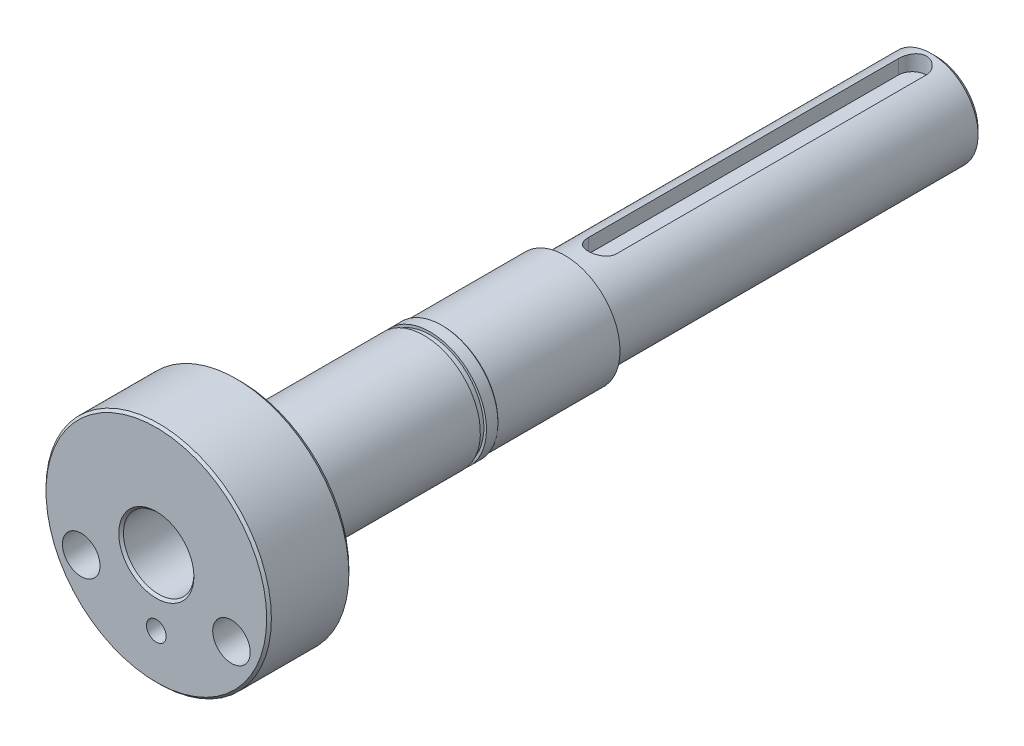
ISO-10303-21;
HEADER;
FILE_DESCRIPTION(('STEP AP214'),'2;1');
FILE_NAME('part.step','',(''),(''),'','','');
FILE_SCHEMA(('AUTOMOTIVE_DESIGN { 1 0 10303 214 1 1 1 1 }'));
ENDSEC;
DATA;
#1=APPLICATION_CONTEXT('core data for automotive mechanical design processes');
#2=APPLICATION_PROTOCOL_DEFINITION('international standard','automotive_design',2000,#1);
#3=PRODUCT_CONTEXT('',#1,'mechanical');
#4=PRODUCT('Part','Part','',(#3));
#5=PRODUCT_RELATED_PRODUCT_CATEGORY('part','',(#4));
#6=PRODUCT_DEFINITION_FORMATION('','',#4);
#7=PRODUCT_DEFINITION_CONTEXT('part definition',#1,'design');
#8=PRODUCT_DEFINITION('design','',#6,#7);
#9=PRODUCT_DEFINITION_SHAPE('','',#8);
#10=(LENGTH_UNIT() NAMED_UNIT(*) SI_UNIT(.MILLI.,.METRE.));
#11=(NAMED_UNIT(*) PLANE_ANGLE_UNIT() SI_UNIT($,.RADIAN.));
#12=(NAMED_UNIT(*) SI_UNIT($,.STERADIAN.) SOLID_ANGLE_UNIT());
#13=UNCERTAINTY_MEASURE_WITH_UNIT(LENGTH_MEASURE(1.E-05),#10,'distance_accuracy_value','');
#14=(GEOMETRIC_REPRESENTATION_CONTEXT(3) GLOBAL_UNCERTAINTY_ASSIGNED_CONTEXT((#13)) GLOBAL_UNIT_ASSIGNED_CONTEXT((#10,
#11,#12)) REPRESENTATION_CONTEXT('',''));
#15=CARTESIAN_POINT('',(0.,0.,0.));
#16=DIRECTION('',(0.,0.,1.));
#17=DIRECTION('',(1.,0.,0.));
#18=AXIS2_PLACEMENT_3D('',#15,#16,#17);
#19=CARTESIAN_POINT('',(0.,0.,0.));
#20=DIRECTION('',(0.,0.,1.));
#21=DIRECTION('',(1.00000000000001,0.,0.));
#22=AXIS2_PLACEMENT_3D('',#19,#20,#21);
#23=PLANE('',#22);
#24=CARTESIAN_POINT('',(0.,0.,0.));
#25=DIRECTION('',(0.,0.,1.));
#26=DIRECTION('',(1.00000000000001,0.,0.));
#27=AXIS2_PLACEMENT_3D('',#24,#25,#26);
#28=CIRCLE('',#27,23.);
#29=CARTESIAN_POINT('',(23.0000000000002,0.,0.));
#30=VERTEX_POINT('',#29);
#31=EDGE_CURVE('E174',#30,#30,#28,.F.);
#32=ORIENTED_EDGE('',*,*,#31,.T.);
#33=EDGE_LOOP('',(#32));
#34=FACE_BOUND('',#33,.T.);
#35=CARTESIAN_POINT('',(16.0000000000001,-8.00000000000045,0.));
#36=DIRECTION('',(0.,0.,1.));
#37=DIRECTION('',(1.00000000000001,0.,0.));
#38=AXIS2_PLACEMENT_3D('',#35,#36,#37);
#39=CIRCLE('',#38,3.99999999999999);
#40=CARTESIAN_POINT('',(20.0000000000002,-8.00000000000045,0.));
#41=VERTEX_POINT('',#40);
#42=EDGE_CURVE('E140',#41,#41,#39,.T.);
#43=ORIENTED_EDGE('',*,*,#42,.T.);
#44=EDGE_LOOP('',(#43));
#45=FACE_BOUND('',#44,.T.);
#46=CARTESIAN_POINT('',(-16.0000000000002,-8.00000000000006,-1.2490009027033E-13));
#47=DIRECTION('',(0.,0.,1.));
#48=DIRECTION('',(1.00000000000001,0.,0.));
#49=AXIS2_PLACEMENT_3D('',#46,#47,#48);
#50=CIRCLE('',#49,4.);
#51=CARTESIAN_POINT('',(-12.0000000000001,-8.00000000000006,-1.2490009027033E-13));
#52=VERTEX_POINT('',#51);
#53=EDGE_CURVE('E136',#52,#52,#50,.T.);
#54=ORIENTED_EDGE('',*,*,#53,.T.);
#55=EDGE_LOOP('',(#54));
#56=FACE_BOUND('',#55,.T.);
#57=CARTESIAN_POINT('',(0.,-14.,0.));
#58=DIRECTION('',(0.,0.,1.));
#59=DIRECTION('',(1.00000000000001,0.,0.));
#60=AXIS2_PLACEMENT_3D('',#57,#58,#59);
#61=CIRCLE('',#60,2.09999999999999);
#62=CARTESIAN_POINT('',(0.592633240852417,-11.9853571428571,0.));
#63=VERTEX_POINT('',#62);
#64=CARTESIAN_POINT('',(-0.592633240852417,-11.9853571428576,0.));
#65=VERTEX_POINT('',#64);
#66=EDGE_CURVE('E131',#63,#65,#61,.F.);
#67=ORIENTED_EDGE('',*,*,#66,.F.);
#68=CARTESIAN_POINT('',(0.,0.,0.));
#69=DIRECTION('',(0.,0.,1.));
#70=DIRECTION('',(1.00000000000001,0.,0.));
#71=AXIS2_PLACEMENT_3D('',#68,#69,#70);
#72=CIRCLE('',#71,12.);
#73=EDGE_CURVE('E167',#65,#63,#72,.F.);
#74=ORIENTED_EDGE('',*,*,#73,.F.);
#75=EDGE_LOOP('',(#67,#74));
#76=FACE_BOUND('',#75,.T.);
#77=ADVANCED_FACE('F40',(#34,#45,#56,#76),#23,.F.);
#78=CARTESIAN_POINT('',(0.,-4.9960036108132E-13,18.));
#79=DIRECTION('',(0.,0.,1.));
#80=DIRECTION('',(1.00000000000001,0.,0.));
#81=AXIS2_PLACEMENT_3D('',#78,#79,#80);
#82=PLANE('',#81);
#83=CARTESIAN_POINT('',(0.,-14.0000000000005,18.));
#84=DIRECTION('',(0.,0.,1.));
#85=DIRECTION('',(1.00000000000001,0.,0.));
#86=AXIS2_PLACEMENT_3D('',#83,#84,#85);
#87=CIRCLE('',#86,2.09999999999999);
#88=CARTESIAN_POINT('',(2.10000000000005,-14.0000000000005,18.));
#89=VERTEX_POINT('',#88);
#90=EDGE_CURVE('E121',#89,#89,#87,.T.);
#91=ORIENTED_EDGE('',*,*,#90,.F.);
#92=EDGE_LOOP('',(#91));
#93=FACE_BOUND('',#92,.T.);
#94=CARTESIAN_POINT('',(-16.,-8.00000000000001,18.));
#95=DIRECTION('',(0.,0.,1.));
#96=DIRECTION('',(1.00000000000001,0.,0.));
#97=AXIS2_PLACEMENT_3D('',#94,#95,#96);
#98=CIRCLE('',#97,4.);
#99=CARTESIAN_POINT('',(-12.,-8.00000000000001,18.));
#100=VERTEX_POINT('',#99);
#101=EDGE_CURVE('E133',#100,#100,#98,.T.);
#102=ORIENTED_EDGE('',*,*,#101,.F.);
#103=EDGE_LOOP('',(#102));
#104=FACE_BOUND('',#103,.T.);
#105=CARTESIAN_POINT('',(16.0000000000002,-8.00000000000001,18.));
#106=DIRECTION('',(0.,0.,1.));
#107=DIRECTION('',(1.00000000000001,0.,0.));
#108=AXIS2_PLACEMENT_3D('',#105,#106,#107);
#109=CIRCLE('',#108,3.99999999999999);
#110=CARTESIAN_POINT('',(20.0000000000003,-8.00000000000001,18.));
#111=VERTEX_POINT('',#110);
#112=EDGE_CURVE('E137',#111,#111,#109,.T.);
#113=ORIENTED_EDGE('',*,*,#112,.F.);
#114=EDGE_LOOP('',(#113));
#115=FACE_BOUND('',#114,.T.);
#116=CARTESIAN_POINT('',(0.,-4.9960036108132E-13,18.));
#117=DIRECTION('',(0.,0.,1.));
#118=DIRECTION('',(1.00000000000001,0.,0.));
#119=AXIS2_PLACEMENT_3D('',#116,#117,#118);
#120=CIRCLE('',#119,8.);
#121=CARTESIAN_POINT('',(8.00000000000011,-4.99600361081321E-13,18.));
#122=VERTEX_POINT('',#121);
#123=EDGE_CURVE('E192',#122,#122,#120,.F.);
#124=ORIENTED_EDGE('',*,*,#123,.T.);
#125=EDGE_LOOP('',(#124));
#126=FACE_BOUND('',#125,.T.);
#127=CARTESIAN_POINT('',(0.,-4.9960036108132E-13,18.));
#128=DIRECTION('',(0.,0.,1.));
#129=DIRECTION('',(1.00000000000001,0.,0.));
#130=AXIS2_PLACEMENT_3D('',#127,#128,#129);
#131=CIRCLE('',#130,23.5);
#132=CARTESIAN_POINT('',(23.5000000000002,-4.99600361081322E-13,18.));
#133=VERTEX_POINT('',#132);
#134=EDGE_CURVE('E183',#133,#133,#131,.T.);
#135=ORIENTED_EDGE('',*,*,#134,.T.);
#136=EDGE_LOOP('',(#135));
#137=FACE_BOUND('',#136,.T.);
#138=ADVANCED_FACE('F282',(#93,#104,#115,#126,#137),#82,.T.);
#139=CARTESIAN_POINT('',(0.,-4.9960036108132E-13,-69.));
#140=DIRECTION('',(0.,0.,-1.));
#141=DIRECTION('',(-1.00000000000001,0.,0.));
#142=AXIS2_PLACEMENT_3D('',#139,#140,#141);
#143=PLANE('',#142);
#144=CARTESIAN_POINT('',(0.,-4.9960036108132E-13,-69.));
#145=DIRECTION('',(0.,0.,-1.));
#146=DIRECTION('',(-1.00000000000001,0.,0.));
#147=AXIS2_PLACEMENT_3D('',#144,#145,#146);
#148=CIRCLE('',#147,11.75);
#149=CARTESIAN_POINT('',(11.7500000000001,-4.99600361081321E-13,-69.));
#150=VERTEX_POINT('',#149);
#151=EDGE_CURVE('E150',#150,#150,#148,.T.);
#152=ORIENTED_EDGE('',*,*,#151,.T.);
#153=EDGE_LOOP('',(#152));
#154=FACE_BOUND('',#153,.T.);
#155=CARTESIAN_POINT('',(0.,-4.9960036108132E-13,-69.));
#156=DIRECTION('',(0.,0.,-1.));
#157=DIRECTION('',(-1.00000000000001,0.,0.));
#158=AXIS2_PLACEMENT_3D('',#155,#156,#157);
#159=CIRCLE('',#158,10.);
#160=CARTESIAN_POINT('',(-10.,-4.9960036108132E-13,-69.));
#161=VERTEX_POINT('',#160);
#162=EDGE_CURVE('E144',#161,#161,#159,.T.);
#163=ORIENTED_EDGE('',*,*,#162,.F.);
#164=EDGE_LOOP('',(#163));
#165=FACE_BOUND('',#164,.T.);
#166=ADVANCED_FACE('F288',(#154,#165),#143,.T.);
#167=CARTESIAN_POINT('',(0.,-4.9960036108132E-13,-39.));
#168=DIRECTION('',(0.,0.,-1.));
#169=DIRECTION('',(-1.00000000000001,0.,0.));
#170=AXIS2_PLACEMENT_3D('',#167,#168,#169);
#171=PLANE('',#170);
#172=CARTESIAN_POINT('',(0.,-4.9960036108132E-13,-39.));
#173=DIRECTION('',(0.,0.,-1.));
#174=DIRECTION('',(-1.00000000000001,0.,0.));
#175=AXIS2_PLACEMENT_3D('',#172,#173,#174);
#176=CIRCLE('',#175,12.);
#177=CARTESIAN_POINT('',(-12.0000000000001,-4.9960036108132E-13,-39.));
#178=VERTEX_POINT('',#177);
#179=EDGE_CURVE('E164',#178,#178,#176,.T.);
#180=ORIENTED_EDGE('',*,*,#179,.T.);
#181=EDGE_LOOP('',(#180));
#182=FACE_BOUND('',#181,.T.);
#183=CARTESIAN_POINT('',(0.,-4.9960036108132E-13,-39.));
#184=DIRECTION('',(0.,0.,-1.));
#185=DIRECTION('',(-1.00000000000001,0.,0.));
#186=AXIS2_PLACEMENT_3D('',#183,#184,#185);
#187=CIRCLE('',#186,11.45);
#188=CARTESIAN_POINT('',(-11.4500000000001,-4.9960036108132E-13,-39.));
#189=VERTEX_POINT('',#188);
#190=EDGE_CURVE('E158',#189,#189,#187,.T.);
#191=ORIENTED_EDGE('',*,*,#190,.F.);
#192=EDGE_LOOP('',(#191));
#193=FACE_BOUND('',#192,.T.);
#194=ADVANCED_FACE('F297',(#182,#193),#171,.T.);
#195=CARTESIAN_POINT('',(0.,-4.9960036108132E-13,18.));
#196=DIRECTION('',(0.,0.,-1.));
#197=DIRECTION('',(-1.00000000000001,0.,0.));
#198=AXIS2_PLACEMENT_3D('',#195,#196,#197);
#199=CYLINDRICAL_SURFACE('',#198,24.);
#200=CARTESIAN_POINT('',(0.,-4.9960036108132E-13,17.5));
#201=DIRECTION('',(0.,0.,1.));
#202=DIRECTION('',(1.00000000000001,0.,0.));
#203=AXIS2_PLACEMENT_3D('',#200,#201,#202);
#204=CIRCLE('',#203,24.);
#205=CARTESIAN_POINT('',(24.0000000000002,-4.99600361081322E-13,17.5));
#206=VERTEX_POINT('',#205);
#207=EDGE_CURVE('E186',#206,#206,#204,.F.);
#208=ORIENTED_EDGE('',*,*,#207,.T.);
#209=EDGE_LOOP('',(#208));
#210=FACE_BOUND('',#209,.T.);
#211=CARTESIAN_POINT('',(0.,0.,1.));
#212=DIRECTION('',(0.,0.,1.));
#213=DIRECTION('',(1.00000000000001,0.,0.));
#214=AXIS2_PLACEMENT_3D('',#211,#212,#213);
#215=CIRCLE('',#214,24.);
#216=CARTESIAN_POINT('',(24.0000000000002,0.,1.));
#217=VERTEX_POINT('',#216);
#218=EDGE_CURVE('E171',#217,#217,#215,.T.);
#219=ORIENTED_EDGE('',*,*,#218,.T.);
#220=EDGE_LOOP('',(#219));
#221=FACE_BOUND('',#220,.T.);
#222=ADVANCED_FACE('F42',(#210,#221),#199,.T.);
#223=CARTESIAN_POINT('',(0.,-4.9960036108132E-13,-39.));
#224=DIRECTION('',(0.,0.,1.));
#225=DIRECTION('',(1.00000000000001,0.,0.));
#226=AXIS2_PLACEMENT_3D('',#223,#224,#225);
#227=CYLINDRICAL_SURFACE('',#226,12.);
#228=ORIENTED_EDGE('',*,*,#179,.F.);
#229=EDGE_LOOP('',(#228));
#230=FACE_BOUND('',#229,.T.);
#231=EDGE_CURVE('E168',#63,#65,#72,.F.);
#232=ORIENTED_EDGE('',*,*,#231,.T.);
#233=ORIENTED_EDGE('',*,*,#73,.T.);
#234=EDGE_LOOP('',(#232,#233));
#235=FACE_BOUND('',#234,.T.);
#236=ADVANCED_FACE('F292',(#230,#235),#227,.T.);
#237=CARTESIAN_POINT('',(0.,0.,-40.3));
#238=DIRECTION('',(0.,0.,1.));
#239=DIRECTION('',(1.00000000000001,0.,0.));
#240=AXIS2_PLACEMENT_3D('',#237,#238,#239);
#241=CYLINDRICAL_SURFACE('',#240,11.45);
#242=CARTESIAN_POINT('',(0.,0.,-40.3));
#243=DIRECTION('',(0.,0.,-1.));
#244=DIRECTION('',(-1.00000000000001,0.,0.));
#245=AXIS2_PLACEMENT_3D('',#242,#243,#244);
#246=CIRCLE('',#245,11.45);
#247=CARTESIAN_POINT('',(-11.4500000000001,0.,-40.3));
#248=VERTEX_POINT('',#247);
#249=EDGE_CURVE('E161',#248,#248,#246,.T.);
#250=ORIENTED_EDGE('',*,*,#249,.F.);
#251=EDGE_LOOP('',(#250));
#252=FACE_BOUND('',#251,.T.);
#253=ORIENTED_EDGE('',*,*,#190,.T.);
#254=EDGE_LOOP('',(#253));
#255=FACE_BOUND('',#254,.T.);
#256=ADVANCED_FACE('F295',(#252,#255),#241,.T.);
#257=CARTESIAN_POINT('',(0.,0.,-40.3));
#258=DIRECTION('',(0.,0.,-1.));
#259=DIRECTION('',(-1.00000000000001,0.,0.));
#260=AXIS2_PLACEMENT_3D('',#257,#258,#259);
#261=PLANE('',#260);
#262=CARTESIAN_POINT('',(0.,0.,-40.3));
#263=DIRECTION('',(0.,0.,-1.));
#264=DIRECTION('',(-1.00000000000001,0.,0.));
#265=AXIS2_PLACEMENT_3D('',#262,#263,#264);
#266=CIRCLE('',#265,12.);
#267=CARTESIAN_POINT('',(-12.0000000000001,0.,-40.3));
#268=VERTEX_POINT('',#267);
#269=EDGE_CURVE('E154',#268,#268,#266,.T.);
#270=ORIENTED_EDGE('',*,*,#269,.F.);
#271=EDGE_LOOP('',(#270));
#272=FACE_BOUND('',#271,.T.);
#273=ORIENTED_EDGE('',*,*,#249,.T.);
#274=EDGE_LOOP('',(#273));
#275=FACE_BOUND('',#274,.T.);
#276=ADVANCED_FACE('F303',(#272,#275),#261,.F.);
#277=CARTESIAN_POINT('',(0.,0.,-43.));
#278=DIRECTION('',(0.,0.,1.));
#279=DIRECTION('',(1.00000000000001,0.,0.));
#280=AXIS2_PLACEMENT_3D('',#277,#278,#279);
#281=CYLINDRICAL_SURFACE('',#280,12.);
#282=CARTESIAN_POINT('',(0.,0.,-42.7500000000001));
#283=DIRECTION('',(0.,0.,-1.));
#284=DIRECTION('',(0.,1.,0.));
#285=AXIS2_PLACEMENT_3D('',#282,#283,#284);
#286=CIRCLE('',#285,12.);
#287=CARTESIAN_POINT('',(0.,12.,-42.7500000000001));
#288=VERTEX_POINT('',#287);
#289=EDGE_CURVE('E11',#288,#288,#286,.F.);
#290=ORIENTED_EDGE('',*,*,#289,.T.);
#291=EDGE_LOOP('',(#290));
#292=FACE_BOUND('',#291,.T.);
#293=ORIENTED_EDGE('',*,*,#269,.T.);
#294=EDGE_LOOP('',(#293));
#295=FACE_BOUND('',#294,.T.);
#296=ADVANCED_FACE('F305',(#292,#295),#281,.T.);
#297=CARTESIAN_POINT('',(0.,-4.9960036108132E-13,-69.));
#298=DIRECTION('',(0.,0.,1.));
#299=DIRECTION('',(1.00000000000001,0.,0.));
#300=AXIS2_PLACEMENT_3D('',#297,#298,#299);
#301=CYLINDRICAL_SURFACE('',#300,11.75);
#302=CARTESIAN_POINT('',(0.,0.,-43.));
#303=DIRECTION('',(0.,0.,-1.));
#304=DIRECTION('',(-1.00000000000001,0.,0.));
#305=AXIS2_PLACEMENT_3D('',#302,#303,#304);
#306=CIRCLE('',#305,11.75);
#307=CARTESIAN_POINT('',(11.7500000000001,-4.99600361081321E-13,-43.));
#308=VERTEX_POINT('',#307);
#309=EDGE_CURVE('E147',#308,#308,#306,.T.);
#310=CARTESIAN_POINT('',(11.7500000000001,-4.99600361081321E-13,-69.));
#311=CARTESIAN_POINT('',(11.7500000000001,-4.99600361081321E-13,-68.7291666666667));
#312=CARTESIAN_POINT('',(11.7500000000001,-4.99600361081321E-13,-68.4583333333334));
#313=CARTESIAN_POINT('',(11.7500000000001,-4.99600361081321E-13,-67.9166666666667));
#314=CARTESIAN_POINT('',(11.7500000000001,-4.99600361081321E-13,-67.6458333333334));
#315=CARTESIAN_POINT('',(11.7500000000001,-4.99600361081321E-13,-67.1041666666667));
#316=CARTESIAN_POINT('',(11.7500000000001,-4.99600361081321E-13,-66.8333333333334));
#317=CARTESIAN_POINT('',(11.7500000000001,-4.99600361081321E-13,-66.2916666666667));
#318=CARTESIAN_POINT('',(11.7500000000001,-4.99600361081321E-13,-66.0208333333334));
#319=CARTESIAN_POINT('',(11.7500000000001,-4.99600361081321E-13,-65.4791666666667));
#320=CARTESIAN_POINT('',(11.7500000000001,-4.99600361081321E-13,-65.2083333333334));
#321=CARTESIAN_POINT('',(11.7500000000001,-4.99600361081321E-13,-64.6666666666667));
#322=CARTESIAN_POINT('',(11.7500000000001,-4.99600361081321E-13,-64.3958333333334));
#323=CARTESIAN_POINT('',(11.7500000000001,-4.99600361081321E-13,-63.8541666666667));
#324=CARTESIAN_POINT('',(11.7500000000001,-4.99600361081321E-13,-63.5833333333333));
#325=CARTESIAN_POINT('',(11.7500000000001,-4.99600361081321E-13,-63.0416666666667));
#326=CARTESIAN_POINT('',(11.7500000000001,-4.99600361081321E-13,-62.7708333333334));
#327=CARTESIAN_POINT('',(11.7500000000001,-4.99600361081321E-13,-62.2291666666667));
#328=CARTESIAN_POINT('',(11.7500000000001,-4.99600361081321E-13,-61.9583333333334));
#329=CARTESIAN_POINT('',(11.7500000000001,-4.99600361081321E-13,-61.4166666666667));
#330=CARTESIAN_POINT('',(11.7500000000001,-4.99600361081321E-13,-61.1458333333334));
#331=CARTESIAN_POINT('',(11.7500000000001,-4.99600361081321E-13,-60.6041666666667));
#332=CARTESIAN_POINT('',(11.7500000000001,-4.99600361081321E-13,-60.3333333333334));
#333=CARTESIAN_POINT('',(11.7500000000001,-4.99600361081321E-13,-59.7916666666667));
#334=CARTESIAN_POINT('',(11.7500000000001,-4.99600361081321E-13,-59.5208333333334));
#335=CARTESIAN_POINT('',(11.7500000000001,-4.99600361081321E-13,-58.9791666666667));
#336=CARTESIAN_POINT('',(11.7500000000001,-4.99600361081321E-13,-58.7083333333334));
#337=CARTESIAN_POINT('',(11.7500000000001,-4.99600361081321E-13,-58.1666666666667));
#338=CARTESIAN_POINT('',(11.7500000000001,-4.99600361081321E-13,-57.8958333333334));
#339=CARTESIAN_POINT('',(11.7500000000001,-4.99600361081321E-13,-57.3541666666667));
#340=CARTESIAN_POINT('',(11.7500000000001,-4.99600361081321E-13,-57.0833333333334));
#341=CARTESIAN_POINT('',(11.7500000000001,-4.99600361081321E-13,-56.5416666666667));
#342=CARTESIAN_POINT('',(11.7500000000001,-4.99600361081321E-13,-56.2708333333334));
#343=CARTESIAN_POINT('',(11.7500000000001,-4.99600361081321E-13,-55.7291666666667));
#344=CARTESIAN_POINT('',(11.7500000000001,-4.99600361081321E-13,-55.4583333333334));
#345=CARTESIAN_POINT('',(11.7500000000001,-4.99600361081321E-13,-54.9166666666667));
#346=CARTESIAN_POINT('',(11.7500000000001,-4.99600361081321E-13,-54.6458333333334));
#347=CARTESIAN_POINT('',(11.7500000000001,-4.99600361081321E-13,-54.1041666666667));
#348=CARTESIAN_POINT('',(11.7500000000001,-4.99600361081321E-13,-53.8333333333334));
#349=CARTESIAN_POINT('',(11.7500000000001,-4.99600361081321E-13,-53.2916666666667));
#350=CARTESIAN_POINT('',(11.7500000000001,-4.99600361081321E-13,-53.0208333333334));
#351=CARTESIAN_POINT('',(11.7500000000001,-4.99600361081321E-13,-52.4791666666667));
#352=CARTESIAN_POINT('',(11.7500000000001,-4.99600361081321E-13,-52.2083333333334));
#353=CARTESIAN_POINT('',(11.7500000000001,-4.99600361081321E-13,-51.6666666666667));
#354=CARTESIAN_POINT('',(11.7500000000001,-4.99600361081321E-13,-51.3958333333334));
#355=CARTESIAN_POINT('',(11.7500000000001,-4.99600361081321E-13,-50.8541666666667));
#356=CARTESIAN_POINT('',(11.7500000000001,-4.99600361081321E-13,-50.5833333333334));
#357=CARTESIAN_POINT('',(11.7500000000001,-4.99600361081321E-13,-50.0416666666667));
#358=CARTESIAN_POINT('',(11.7500000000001,-4.99600361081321E-13,-49.7708333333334));
#359=CARTESIAN_POINT('',(11.7500000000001,-4.99600361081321E-13,-49.2291666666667));
#360=CARTESIAN_POINT('',(11.7500000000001,-4.99600361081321E-13,-48.9583333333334));
#361=CARTESIAN_POINT('',(11.7500000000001,-4.99600361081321E-13,-48.4166666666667));
#362=CARTESIAN_POINT('',(11.7500000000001,-4.99600361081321E-13,-48.1458333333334));
#363=CARTESIAN_POINT('',(11.7500000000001,-4.99600361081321E-13,-47.6041666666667));
#364=CARTESIAN_POINT('',(11.7500000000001,-4.99600361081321E-13,-47.3333333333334));
#365=CARTESIAN_POINT('',(11.7500000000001,-4.99600361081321E-13,-46.7916666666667));
#366=CARTESIAN_POINT('',(11.7500000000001,-4.99600361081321E-13,-46.5208333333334));
#367=CARTESIAN_POINT('',(11.7500000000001,-4.99600361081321E-13,-45.9791666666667));
#368=CARTESIAN_POINT('',(11.7500000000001,-4.99600361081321E-13,-45.7083333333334));
#369=CARTESIAN_POINT('',(11.7500000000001,-4.99600361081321E-13,-45.1666666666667));
#370=CARTESIAN_POINT('',(11.7500000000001,-4.99600361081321E-13,-44.8958333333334));
#371=CARTESIAN_POINT('',(11.7500000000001,-4.99600361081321E-13,-44.3541666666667));
#372=CARTESIAN_POINT('',(11.7500000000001,-4.99600361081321E-13,-44.0833333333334));
#373=CARTESIAN_POINT('',(11.7500000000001,-4.99600361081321E-13,-43.5416666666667));
#374=CARTESIAN_POINT('',(11.7500000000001,-4.99600361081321E-13,-43.2708333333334));
#375=CARTESIAN_POINT('',(11.7500000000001,-4.99600361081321E-13,-43.));
#376=B_SPLINE_CURVE_WITH_KNOTS('',3,(#310,#311,#312,#313,#314,#315,#316,#317,#318,#319,#320,
#321,#322,#323,#324,#325,#326,#327,#328,#329,#330,#331,#332,#333,#334,#335,#336,#337,#338,#339,
#340,#341,#342,#343,#344,#345,#346,#347,#348,#349,#350,#351,#352,#353,#354,#355,#356,#357,#358,
#359,#360,#361,#362,#363,#364,#365,#366,#367,#368,#369,#370,#371,#372,#373,#374,#375),
.UNSPECIFIED.,.F.,.F.,(4,2,2,2,2,2,2,2,2,2,2,2,2,2,2,2,2,2,2,2,2,2,2,2,2,2,2,2,2,2,2,2,4),(0.,
0.812500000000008,1.625,2.43750000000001,3.25,4.06250000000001,4.875,5.68750000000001,
6.50000000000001,7.31250000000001,8.12500000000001,8.93750000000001,9.75000000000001,10.5625,
11.375,12.1875,13.,13.8125,14.625,15.4375,16.25,17.0625,17.875,18.6875,19.5,20.3125,21.125,
21.9375,22.75,23.5625,24.375,25.1875,26.),.UNSPECIFIED.);
#377=EDGE_CURVE('BSEAM277',#150,#308,#376,.T.);
#378=ORIENTED_EDGE('',*,*,#151,.F.);
#379=ORIENTED_EDGE('',*,*,#309,.T.);
#380=ORIENTED_EDGE('',*,*,#377,.T.);
#381=ORIENTED_EDGE('',*,*,#377,.F.);
#382=EDGE_LOOP('',(#378,#380,#379,#381));
#383=FACE_BOUND('',#382,.T.);
#384=ADVANCED_FACE('F277',(#383),#301,.T.);
#385=CARTESIAN_POINT('',(0.,0.,-148.));
#386=DIRECTION('',(0.,0.,1.));
#387=DIRECTION('',(1.00000000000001,0.,0.));
#388=AXIS2_PLACEMENT_3D('',#385,#386,#387);
#389=CYLINDRICAL_SURFACE('',#388,10.);
#390=CARTESIAN_POINT('',(0.,9.99999999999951,-74.));
#391=CARTESIAN_POINT('',(-0.164577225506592,9.9999985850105,-74.0000019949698));
#392=CARTESIAN_POINT('',(-0.329174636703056,9.99589831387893,-74.013587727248));
#393=CARTESIAN_POINT('',(-0.653576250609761,9.97994211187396,-74.0674427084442));
#394=CARTESIAN_POINT('',(-0.813379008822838,9.9680838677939,-74.1077199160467));
#395=CARTESIAN_POINT('',(-1.12346541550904,9.93791105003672,-74.2134920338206));
#396=CARTESIAN_POINT('',(-1.27376272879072,9.91960600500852,-74.2789497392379));
#397=CARTESIAN_POINT('',(-1.56124836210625,9.8784421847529,-74.4330721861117));
#398=CARTESIAN_POINT('',(-1.69843493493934,9.85558280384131,-74.5217400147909));
#399=CARTESIAN_POINT('',(-1.95974359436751,9.80701474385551,-74.7224480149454));
#400=CARTESIAN_POINT('',(-2.08343614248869,9.78124767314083,-74.8350332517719));
#401=CARTESIAN_POINT('',(-2.31049841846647,9.73011668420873,-75.0792184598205));
#402=CARTESIAN_POINT('',(-2.4138647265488,9.70475283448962,-75.21082162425));
#403=CARTESIAN_POINT('',(-2.59960075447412,9.65668227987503,-75.4929415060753));
#404=CARTESIAN_POINT('',(-2.68144618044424,9.63404813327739,-75.6438169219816));
#405=CARTESIAN_POINT('',(-2.81842789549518,9.59487240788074,-75.9579785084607));
#406=CARTESIAN_POINT('',(-2.87357059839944,9.57832936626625,-76.121261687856));
#407=CARTESIAN_POINT('',(-2.95403267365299,9.55381741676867,-76.4507805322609));
#408=CARTESIAN_POINT('',(-2.98014392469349,9.54562138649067,-76.6168054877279));
#409=CARTESIAN_POINT('',(-3.00427461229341,9.53805579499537,-76.9510663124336));
#410=CARTESIAN_POINT('',(-3.00230085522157,9.53868409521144,-77.1193016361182));
#411=CARTESIAN_POINT('',(-2.97093954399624,9.54849488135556,-77.446767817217));
#412=CARTESIAN_POINT('',(-2.94254410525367,9.55736777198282,-77.6061045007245));
#413=CARTESIAN_POINT('',(-2.86074840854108,9.5821671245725,-77.9176395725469));
#414=CARTESIAN_POINT('',(-2.80734568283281,9.59809428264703,-78.0698372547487));
#415=CARTESIAN_POINT('',(-2.67632053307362,9.63545466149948,-78.3652006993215));
#416=CARTESIAN_POINT('',(-2.59837633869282,9.65696032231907,-78.5082141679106));
#417=CARTESIAN_POINT('',(-2.42070445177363,9.70301974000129,-78.7794640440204));
#418=CARTESIAN_POINT('',(-2.32097148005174,9.7275742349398,-78.9076968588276));
#419=CARTESIAN_POINT('',(-2.09762581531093,9.77822022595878,-79.1513723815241));
#420=CARTESIAN_POINT('',(-1.97318981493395,9.80433308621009,-79.2660573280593));
#421=CARTESIAN_POINT('',(-1.70652651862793,9.85424488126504,-79.4731079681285));
#422=CARTESIAN_POINT('',(-1.56429810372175,9.87804367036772,-79.5654722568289));
#423=CARTESIAN_POINT('',(-1.26471007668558,9.92086320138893,-79.7257198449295));
#424=CARTESIAN_POINT('',(-1.10725549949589,9.93985087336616,-79.7934350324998));
#425=CARTESIAN_POINT('',(-0.782490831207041,9.97067043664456,-79.9011991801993));
#426=CARTESIAN_POINT('',(-0.615183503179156,9.98250432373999,-79.941255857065));
#427=CARTESIAN_POINT('',(-0.281904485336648,9.99736729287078,-79.9913043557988));
#428=CARTESIAN_POINT('',(-0.11610019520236,10.0006970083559,-80.0023231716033));
#429=CARTESIAN_POINT('',(0.214999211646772,9.99905846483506,-79.9968616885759));
#430=CARTESIAN_POINT('',(0.380294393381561,9.99409131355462,-79.9803850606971));
#431=CARTESIAN_POINT('',(0.701807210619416,9.97661393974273,-79.921230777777));
#432=CARTESIAN_POINT('',(0.858145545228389,9.96427659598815,-79.8791532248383));
#433=CARTESIAN_POINT('',(1.1615092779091,9.93348695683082,-79.7707135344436));
#434=CARTESIAN_POINT('',(1.30853355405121,9.91503392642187,-79.7043484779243));
#435=CARTESIAN_POINT('',(1.59287437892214,9.87339308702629,-79.5474936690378));
#436=CARTESIAN_POINT('',(1.72988765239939,9.8501056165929,-79.4564813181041));
#437=CARTESIAN_POINT('',(1.98704661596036,9.80146937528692,-79.2535504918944));
#438=CARTESIAN_POINT('',(2.10718806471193,9.77612008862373,-79.1416267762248));
#439=CARTESIAN_POINT('',(2.33171489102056,9.72506343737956,-78.8952253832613));
#440=CARTESIAN_POINT('',(2.43536962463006,9.69937650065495,-78.7600762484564));
#441=CARTESIAN_POINT('',(2.6185799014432,9.65153030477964,-78.4737441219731));
#442=CARTESIAN_POINT('',(2.69813607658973,9.62937095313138,-78.3225615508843));
#443=CARTESIAN_POINT('',(2.83034694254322,9.59134379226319,-78.00893501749));
#444=CARTESIAN_POINT('',(2.88312693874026,9.57544675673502,-77.8465476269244));
#445=CARTESIAN_POINT('',(2.96043461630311,9.55183188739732,-77.5146240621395));
#446=CARTESIAN_POINT('',(2.98497197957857,9.54411125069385,-77.3450903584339));
#447=CARTESIAN_POINT('',(3.00443968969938,9.53799944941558,-77.0112769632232));
#448=CARTESIAN_POINT('',(3.00056110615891,9.53923294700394,-76.8470726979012));
#449=CARTESIAN_POINT('',(2.96615010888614,9.54998802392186,-76.5217717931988));
#450=CARTESIAN_POINT('',(2.93561876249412,9.55950927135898,-76.360675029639));
#451=CARTESIAN_POINT('',(2.84953777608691,9.5855152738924,-76.0481092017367));
#452=CARTESIAN_POINT('',(2.79430351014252,9.60191209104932,-75.8965454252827));
#453=CARTESIAN_POINT('',(2.66063014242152,9.63980557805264,-75.6047151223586));
#454=CARTESIAN_POINT('',(2.58218659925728,9.66130322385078,-75.4644507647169));
#455=CARTESIAN_POINT('',(2.40097527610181,9.70795352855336,-75.1936737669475));
#456=CARTESIAN_POINT('',(2.29742552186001,9.73321080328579,-75.0637024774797));
#457=CARTESIAN_POINT('',(2.07034869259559,9.78402640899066,-74.8225950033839));
#458=CARTESIAN_POINT('',(1.946816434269,9.80958481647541,-74.7114637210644));
#459=CARTESIAN_POINT('',(1.67893152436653,9.85901873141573,-74.5079531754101));
#460=CARTESIAN_POINT('',(1.53407577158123,9.88282319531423,-74.4162171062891));
#461=CARTESIAN_POINT('',(1.23028274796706,9.92521360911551,-74.2585296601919));
#462=CARTESIAN_POINT('',(1.07135210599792,9.94380199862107,-74.192566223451));
#463=CARTESIAN_POINT('',(0.761515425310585,9.97204349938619,-74.0942094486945));
#464=CARTESIAN_POINT('',(0.611573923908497,9.98244054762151,-74.0589766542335));
#465=CARTESIAN_POINT('',(0.307760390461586,9.99641888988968,-74.0118729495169));
#466=CARTESIAN_POINT('',(0.153889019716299,10.0000013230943,-73.9999981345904));
#467=CARTESIAN_POINT('',(0.,9.99999999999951,-74.));
#468=B_SPLINE_CURVE_WITH_KNOTS('',3,(#390,#391,#392,#393,#394,#395,#396,#397,#398,#399,#400,
#401,#402,#403,#404,#405,#406,#407,#408,#409,#410,#411,#412,#413,#414,#415,#416,#417,#418,#419,
#420,#421,#422,#423,#424,#425,#426,#427,#428,#429,#430,#431,#432,#433,#434,#435,#436,#437,#438,
#439,#440,#441,#442,#443,#444,#445,#446,#447,#448,#449,#450,#451,#452,#453,#454,#455,#456,#457,
#458,#459,#460,#461,#462,#463,#464,#465,#466,#467),.UNSPECIFIED.,.T.,.F.,(4,2,2,2,2,2,2,2,2,2,2,
2,2,2,2,2,2,2,2,2,2,2,2,2,2,2,2,2,2,2,2,2,2,2,2,2,2,2,4),(0.,0.493166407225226,
0.986479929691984,1.47906735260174,1.97172032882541,2.47711205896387,2.98258874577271,
3.4994296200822,4.01614629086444,4.51839378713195,5.02051956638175,5.50452033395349,
5.98856887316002,6.47924852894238,6.97004720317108,7.48134208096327,7.99266913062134,
8.50742093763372,9.0220290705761,9.51817618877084,10.0142570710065,10.4991349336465,
10.9840710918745,11.4802261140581,11.9765056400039,12.4908080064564,13.0050968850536,
13.516956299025,14.0286401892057,14.5190031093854,15.0093463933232,15.4936008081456,
15.9779479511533,16.4799385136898,16.9820594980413,17.4988599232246,18.0154182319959,
18.4766338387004,18.9377723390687),.UNSPECIFIED.);
#469=CARTESIAN_POINT('',(3.00000000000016,9.53939201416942,-76.9999999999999));
#470=VERTEX_POINT('',#469);
#471=CARTESIAN_POINT('',(-3.,9.53939201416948,-77.));
#472=VERTEX_POINT('',#471);
#473=EDGE_CURVE('E207',#470,#472,#468,.T.);
#474=ORIENTED_EDGE('',*,*,#473,.T.);
#475=DIRECTION('',(0.,0.,1.));
#476=VECTOR('',#475,1.);
#477=CARTESIAN_POINT('',(-3.00000000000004,9.53939201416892,-148.));
#478=LINE('',#477,#476);
#479=CARTESIAN_POINT('',(-3.00000000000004,9.53939201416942,-143.));
#480=VERTEX_POINT('',#479);
#481=EDGE_CURVE('E48',#472,#480,#478,.F.);
#482=ORIENTED_EDGE('',*,*,#481,.T.);
#483=CARTESIAN_POINT('',(0.,10.,-140.));
#484=CARTESIAN_POINT('',(-0.164577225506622,9.99999858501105,-140.00000199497));
#485=CARTESIAN_POINT('',(-0.329174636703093,9.99589831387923,-140.013587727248));
#486=CARTESIAN_POINT('',(-0.653576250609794,9.97994211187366,-140.067442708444));
#487=CARTESIAN_POINT('',(-0.813379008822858,9.96808386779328,-140.107719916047));
#488=CARTESIAN_POINT('',(-1.12346541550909,9.93791105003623,-140.213492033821));
#489=CARTESIAN_POINT('',(-1.27376272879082,9.91960600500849,-140.278949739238));
#490=CARTESIAN_POINT('',(-1.56124836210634,9.8784421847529,-140.433072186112));
#491=CARTESIAN_POINT('',(-1.69843493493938,9.85558280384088,-140.521740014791));
#492=CARTESIAN_POINT('',(-1.95974359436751,9.80701474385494,-140.722448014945));
#493=CARTESIAN_POINT('',(-2.08343614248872,9.78124767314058,-140.835033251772));
#494=CARTESIAN_POINT('',(-2.31049841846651,9.73011668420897,-141.07921845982));
#495=CARTESIAN_POINT('',(-2.41386472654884,9.70475283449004,-141.21082162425));
#496=CARTESIAN_POINT('',(-2.59960075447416,9.65668227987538,-141.492941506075));
#497=CARTESIAN_POINT('',(-2.68144618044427,9.63404813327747,-141.643816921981));
#498=CARTESIAN_POINT('',(-2.81842789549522,9.59487240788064,-141.957978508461));
#499=CARTESIAN_POINT('',(-2.87357059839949,9.57832936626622,-142.121261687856));
#500=CARTESIAN_POINT('',(-2.95403267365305,9.55381741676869,-142.450780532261));
#501=CARTESIAN_POINT('',(-2.98014392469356,9.54562138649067,-142.616805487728));
#502=CARTESIAN_POINT('',(-3.00427461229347,9.53805579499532,-142.951066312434));
#503=CARTESIAN_POINT('',(-3.00230085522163,9.53868409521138,-143.119301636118));
#504=CARTESIAN_POINT('',(-2.97093954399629,9.54849488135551,-143.446767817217));
#505=CARTESIAN_POINT('',(-2.94254410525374,9.5573677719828,-143.606104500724));
#506=CARTESIAN_POINT('',(-2.86074840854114,9.58216712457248,-143.917639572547));
#507=CARTESIAN_POINT('',(-2.80734568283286,9.59809428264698,-144.069837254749));
#508=CARTESIAN_POINT('',(-2.67632053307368,9.63545466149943,-144.365200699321));
#509=CARTESIAN_POINT('',(-2.59837633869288,9.65696032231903,-144.508214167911));
#510=CARTESIAN_POINT('',(-2.42070445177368,9.7030197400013,-144.77946404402));
#511=CARTESIAN_POINT('',(-2.32097148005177,9.72757423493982,-144.907696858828));
#512=CARTESIAN_POINT('',(-2.09762581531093,9.77822022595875,-145.151372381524));
#513=CARTESIAN_POINT('',(-1.97318981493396,9.80433308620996,-145.266057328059));
#514=CARTESIAN_POINT('',(-1.70652651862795,9.85424488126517,-145.473107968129));
#515=CARTESIAN_POINT('',(-1.56429810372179,9.87804367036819,-145.565472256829));
#516=CARTESIAN_POINT('',(-1.26471007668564,9.92086320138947,-145.725719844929));
#517=CARTESIAN_POINT('',(-1.10725549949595,9.93985087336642,-145.7934350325));
#518=CARTESIAN_POINT('',(-0.782490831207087,9.97067043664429,-145.901199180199));
#519=CARTESIAN_POINT('',(-0.615183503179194,9.98250432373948,-145.941255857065));
#520=CARTESIAN_POINT('',(-0.28190448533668,9.99736729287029,-145.991304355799));
#521=CARTESIAN_POINT('',(-0.116100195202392,10.0006970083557,-146.002323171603));
#522=CARTESIAN_POINT('',(0.214999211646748,9.99905846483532,-145.996861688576));
#523=CARTESIAN_POINT('',(0.380294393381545,9.99409131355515,-145.980385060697));
#524=CARTESIAN_POINT('',(0.701807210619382,9.97661393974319,-145.921230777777));
#525=CARTESIAN_POINT('',(0.858145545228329,9.96427659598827,-145.879153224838));
#526=CARTESIAN_POINT('',(1.16150927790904,9.93348695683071,-145.770713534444));
#527=CARTESIAN_POINT('',(1.30853355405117,9.91503392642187,-145.704348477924));
#528=CARTESIAN_POINT('',(1.59287437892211,9.87339308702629,-145.547493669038));
#529=CARTESIAN_POINT('',(1.72988765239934,9.85010561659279,-145.456481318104));
#530=CARTESIAN_POINT('',(1.98704661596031,9.80146937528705,-145.253550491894));
#531=CARTESIAN_POINT('',(2.1071880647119,9.77612008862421,-145.141626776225));
#532=CARTESIAN_POINT('',(2.33171489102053,9.72506343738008,-144.895225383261));
#533=CARTESIAN_POINT('',(2.43536962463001,9.69937650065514,-144.760076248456));
#534=CARTESIAN_POINT('',(2.61857990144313,9.65153030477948,-144.473744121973));
#535=CARTESIAN_POINT('',(2.69813607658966,9.6293709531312,-144.322561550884));
#536=CARTESIAN_POINT('',(2.83034694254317,9.59134379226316,-144.00893501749));
#537=CARTESIAN_POINT('',(2.88312693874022,9.57544675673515,-143.846547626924));
#538=CARTESIAN_POINT('',(2.96043461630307,9.55183188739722,-143.514624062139));
#539=CARTESIAN_POINT('',(2.98497197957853,9.54411125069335,-143.345090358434));
#540=CARTESIAN_POINT('',(3.00443968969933,9.53799944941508,-143.011276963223));
#541=CARTESIAN_POINT('',(3.00056110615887,9.53923294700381,-142.847072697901));
#542=CARTESIAN_POINT('',(2.9661501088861,9.54998802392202,-142.521771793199));
#543=CARTESIAN_POINT('',(2.93561876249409,9.55950927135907,-142.360675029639));
#544=CARTESIAN_POINT('',(2.84953777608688,9.58551527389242,-142.048109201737));
#545=CARTESIAN_POINT('',(2.79430351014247,9.60191209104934,-141.896545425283));
#546=CARTESIAN_POINT('',(2.66063014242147,9.63980557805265,-141.604715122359));
#547=CARTESIAN_POINT('',(2.58218659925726,9.66130322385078,-141.464450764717));
#548=CARTESIAN_POINT('',(2.4009752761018,9.70795352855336,-141.193673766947));
#549=CARTESIAN_POINT('',(2.29742552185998,9.73321080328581,-141.06370247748));
#550=CARTESIAN_POINT('',(2.07034869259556,9.78402640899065,-140.822595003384));
#551=CARTESIAN_POINT('',(1.94681643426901,9.80958481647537,-140.711463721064));
#552=CARTESIAN_POINT('',(1.67893152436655,9.85901873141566,-140.50795317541));
#553=CARTESIAN_POINT('',(1.53407577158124,9.88282319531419,-140.416217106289));
#554=CARTESIAN_POINT('',(1.23028274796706,9.92521360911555,-140.258529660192));
#555=CARTESIAN_POINT('',(1.07135210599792,9.94380199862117,-140.192566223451));
#556=CARTESIAN_POINT('',(0.761515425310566,9.97204349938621,-140.094209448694));
#557=CARTESIAN_POINT('',(0.611573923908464,9.98244054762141,-140.058976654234));
#558=CARTESIAN_POINT('',(0.307760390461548,9.99641888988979,-140.011872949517));
#559=CARTESIAN_POINT('',(0.153889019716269,10.0000013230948,-139.99999813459));
#560=CARTESIAN_POINT('',(0.,10.,-140.));
#561=B_SPLINE_CURVE_WITH_KNOTS('',3,(#483,#484,#485,#486,#487,#488,#489,#490,#491,#492,#493,
#494,#495,#496,#497,#498,#499,#500,#501,#502,#503,#504,#505,#506,#507,#508,#509,#510,#511,#512,
#513,#514,#515,#516,#517,#518,#519,#520,#521,#522,#523,#524,#525,#526,#527,#528,#529,#530,#531,
#532,#533,#534,#535,#536,#537,#538,#539,#540,#541,#542,#543,#544,#545,#546,#547,#548,#549,#550,
#551,#552,#553,#554,#555,#556,#557,#558,#559,#560),.UNSPECIFIED.,.T.,.F.,(4,2,2,2,2,2,2,2,2,2,2,
2,2,2,2,2,2,2,2,2,2,2,2,2,2,2,2,2,2,2,2,2,2,2,2,2,2,2,4),(0.,0.493166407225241,
0.986479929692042,1.4790673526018,1.97172032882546,2.47711205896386,2.98258874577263,
3.49942962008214,4.01614629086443,4.51839378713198,5.02051956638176,5.5045203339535,
5.98856887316,6.47924852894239,6.97004720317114,7.48134208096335,7.99266913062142,
8.50742093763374,9.02202907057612,9.51817618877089,10.0142570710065,10.4991349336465,
10.9840710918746,11.4802261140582,11.9765056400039,12.4908080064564,13.0050968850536,
13.5169562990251,14.0286401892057,14.5190031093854,15.0093463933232,15.4936008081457,
15.9779479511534,16.4799385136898,16.9820594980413,17.4988599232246,18.015418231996,
18.4766338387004,18.9377723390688),.UNSPECIFIED.);
#562=CARTESIAN_POINT('',(3.00000000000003,9.53939201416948,-143.));
#563=VERTEX_POINT('',#562);
#564=EDGE_CURVE('E195',#480,#563,#561,.T.);
#565=ORIENTED_EDGE('',*,*,#564,.T.);
#566=DIRECTION('',(0.,0.,1.));
#567=VECTOR('',#566,1.);
#568=CARTESIAN_POINT('',(3.00000000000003,9.53939201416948,-148.));
#569=LINE('',#568,#567);
#570=EDGE_CURVE('E341',#563,#470,#569,.T.);
#571=ORIENTED_EDGE('',*,*,#570,.T.);
#572=EDGE_LOOP('',(#474,#482,#565,#571));
#573=FACE_BOUND('',#572,.T.);
#574=CARTESIAN_POINT('',(0.,0.,-147.));
#575=DIRECTION('',(0.,0.,-1.));
#576=DIRECTION('',(-1.00000000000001,0.,0.));
#577=AXIS2_PLACEMENT_3D('',#574,#575,#576);
#578=CIRCLE('',#577,10.);
#579=CARTESIAN_POINT('',(-10.0000000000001,0.,-147.));
#580=VERTEX_POINT('',#579);
#581=EDGE_CURVE('E180',#580,#580,#578,.F.);
#582=ORIENTED_EDGE('',*,*,#581,.T.);
#583=EDGE_LOOP('',(#582));
#584=FACE_BOUND('',#583,.T.);
#585=ORIENTED_EDGE('',*,*,#162,.T.);
#586=EDGE_LOOP('',(#585));
#587=FACE_BOUND('',#586,.T.);
#588=ADVANCED_FACE('F213',(#573,#584,#587),#389,.T.);
#589=CARTESIAN_POINT('',(0.,0.,-148.));
#590=DIRECTION('',(0.,0.,-1.));
#591=DIRECTION('',(-1.00000000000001,0.,0.));
#592=AXIS2_PLACEMENT_3D('',#589,#590,#591);
#593=PLANE('',#592);
#594=CARTESIAN_POINT('',(0.,0.,-148.));
#595=DIRECTION('',(0.,0.,-1.));
#596=DIRECTION('',(-1.00000000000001,0.,0.));
#597=AXIS2_PLACEMENT_3D('',#594,#595,#596);
#598=CIRCLE('',#597,2.5);
#599=CARTESIAN_POINT('',(-2.50000000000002,0.,-148.));
#600=VERTEX_POINT('',#599);
#601=EDGE_CURVE('E101',#600,#600,#598,.T.);
#602=ORIENTED_EDGE('',*,*,#601,.F.);
#603=EDGE_LOOP('',(#602));
#604=FACE_BOUND('',#603,.T.);
#605=CARTESIAN_POINT('',(0.,0.,-148.));
#606=DIRECTION('',(0.,0.,-1.));
#607=DIRECTION('',(-1.00000000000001,0.,0.));
#608=AXIS2_PLACEMENT_3D('',#605,#606,#607);
#609=CIRCLE('',#608,9.);
#610=CARTESIAN_POINT('',(-9.00000000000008,0.,-148.));
#611=VERTEX_POINT('',#610);
#612=EDGE_CURVE('E177',#611,#611,#609,.T.);
#613=ORIENTED_EDGE('',*,*,#612,.T.);
#614=EDGE_LOOP('',(#613));
#615=FACE_BOUND('',#614,.T.);
#616=ADVANCED_FACE('F270',(#604,#615),#593,.T.);
#617=CARTESIAN_POINT('',(0.,0.,1.));
#618=DIRECTION('',(0.,0.,1.));
#619=DIRECTION('',(1.00000000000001,0.,0.));
#620=AXIS2_PLACEMENT_3D('',#617,#618,#619);
#621=CONICAL_SURFACE('',#620,24.,0.78539816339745);
#622=ORIENTED_EDGE('',*,*,#31,.F.);
#623=EDGE_LOOP('',(#622));
#624=FACE_BOUND('',#623,.T.);
#625=ORIENTED_EDGE('',*,*,#218,.F.);
#626=EDGE_LOOP('',(#625));
#627=FACE_BOUND('',#626,.T.);
#628=ADVANCED_FACE('F267',(#624,#627),#621,.T.);
#629=CARTESIAN_POINT('',(0.,0.,-148.));
#630=DIRECTION('',(0.,0.,1.));
#631=DIRECTION('',(1.00000000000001,0.,0.));
#632=AXIS2_PLACEMENT_3D('',#629,#630,#631);
#633=CONICAL_SURFACE('',#632,9.,0.785398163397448);
#634=ORIENTED_EDGE('',*,*,#581,.F.);
#635=EDGE_LOOP('',(#634));
#636=FACE_BOUND('',#635,.T.);
#637=ORIENTED_EDGE('',*,*,#612,.F.);
#638=EDGE_LOOP('',(#637));
#639=FACE_BOUND('',#638,.T.);
#640=ADVANCED_FACE('F263',(#636,#639),#633,.T.);
#641=CARTESIAN_POINT('',(0.,-4.9960036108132E-13,18.));
#642=DIRECTION('',(0.,0.,-1.));
#643=DIRECTION('',(-1.00000000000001,0.,0.));
#644=AXIS2_PLACEMENT_3D('',#641,#642,#643);
#645=CONICAL_SURFACE('',#644,23.5,0.785398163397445);
#646=ORIENTED_EDGE('',*,*,#207,.F.);
#647=EDGE_LOOP('',(#646));
#648=FACE_BOUND('',#647,.T.);
#649=ORIENTED_EDGE('',*,*,#134,.F.);
#650=EDGE_LOOP('',(#649));
#651=FACE_BOUND('',#650,.T.);
#652=ADVANCED_FACE('F259',(#648,#651),#645,.T.);
#653=CARTESIAN_POINT('',(0.,-4.9960036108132E-13,19.0135874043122));
#654=DIRECTION('',(0.,0.,1.));
#655=DIRECTION('',(1.00000000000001,0.,0.));
#656=AXIS2_PLACEMENT_3D('',#653,#654,#655);
#657=CYLINDRICAL_SURFACE('',#656,7.5);
#658=CARTESIAN_POINT('',(0.,-4.9960036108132E-13,17.5));
#659=DIRECTION('',(0.,0.,1.));
#660=DIRECTION('',(1.00000000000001,0.,0.));
#661=AXIS2_PLACEMENT_3D('',#658,#659,#660);
#662=CIRCLE('',#661,7.5);
#663=CARTESIAN_POINT('',(7.50000000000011,-4.99600361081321E-13,17.5));
#664=VERTEX_POINT('',#663);
#665=EDGE_CURVE('E189',#664,#664,#662,.T.);
#666=ORIENTED_EDGE('',*,*,#665,.T.);
#667=EDGE_LOOP('',(#666));
#668=FACE_BOUND('',#667,.T.);
#669=CARTESIAN_POINT('',(0.,-4.9960036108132E-13,-31.7484434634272));
#670=DIRECTION('',(0.,0.,1.));
#671=DIRECTION('',(1.00000000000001,0.,0.));
#672=AXIS2_PLACEMENT_3D('',#669,#670,#671);
#673=CIRCLE('',#672,7.5);
#674=CARTESIAN_POINT('',(7.50000000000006,-4.99600361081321E-13,-31.7484434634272));
#675=VERTEX_POINT('',#674);
#676=EDGE_CURVE('E141',#675,#675,#673,.T.);
#677=ORIENTED_EDGE('',*,*,#676,.F.);
#678=EDGE_LOOP('',(#677));
#679=FACE_BOUND('',#678,.T.);
#680=ADVANCED_FACE('F255',(#668,#679),#657,.F.);
#681=CARTESIAN_POINT('',(0.,-4.9960036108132E-13,-37.));
#682=DIRECTION('',(0.,0.,1.));
#683=DIRECTION('',(1.00000000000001,0.,0.));
#684=AXIS2_PLACEMENT_3D('',#681,#682,#683);
#685=CONICAL_SURFACE('',#684,0.,0.959931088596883);
#686=ORIENTED_EDGE('',*,*,#676,.T.);
#687=EDGE_LOOP('',(#686));
#688=FACE_BOUND('',#687,.T.);
#689=CARTESIAN_POINT('',(0.,-4.9960036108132E-13,-37.));
#690=VERTEX_POINT('',#689);
#691=VERTEX_LOOP('',#690);
#692=FACE_BOUND('',#691,.T.);
#693=ADVANCED_FACE('F251',(#688,#692),#685,.F.);
#694=CARTESIAN_POINT('',(0.,-4.9960036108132E-13,17.5));
#695=DIRECTION('',(0.,0.,1.));
#696=DIRECTION('',(1.00000000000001,0.,0.));
#697=AXIS2_PLACEMENT_3D('',#694,#695,#696);
#698=CONICAL_SURFACE('',#697,7.5,0.785398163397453);
#699=ORIENTED_EDGE('',*,*,#123,.F.);
#700=EDGE_LOOP('',(#699));
#701=FACE_BOUND('',#700,.T.);
#702=ORIENTED_EDGE('',*,*,#665,.F.);
#703=EDGE_LOOP('',(#702));
#704=FACE_BOUND('',#703,.T.);
#705=ADVANCED_FACE('F247',(#701,#704),#698,.F.);
#706=CARTESIAN_POINT('',(16.0000000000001,-8.00000000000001,-148.));
#707=DIRECTION('',(0.,0.,1.));
#708=DIRECTION('',(1.00000000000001,0.,0.));
#709=AXIS2_PLACEMENT_3D('',#706,#707,#708);
#710=CYLINDRICAL_SURFACE('',#709,3.99999999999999);
#711=ORIENTED_EDGE('',*,*,#112,.T.);
#712=EDGE_LOOP('',(#711));
#713=FACE_BOUND('',#712,.T.);
#714=ORIENTED_EDGE('',*,*,#42,.F.);
#715=EDGE_LOOP('',(#714));
#716=FACE_BOUND('',#715,.T.);
#717=ADVANCED_FACE('F243',(#713,#716),#710,.F.);
#718=CARTESIAN_POINT('',(-16.0000000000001,-8.00000000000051,-148.));
#719=DIRECTION('',(0.,0.,1.));
#720=DIRECTION('',(1.00000000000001,0.,0.));
#721=AXIS2_PLACEMENT_3D('',#718,#719,#720);
#722=CYLINDRICAL_SURFACE('',#721,4.);
#723=ORIENTED_EDGE('',*,*,#101,.T.);
#724=EDGE_LOOP('',(#723));
#725=FACE_BOUND('',#724,.T.);
#726=ORIENTED_EDGE('',*,*,#53,.F.);
#727=EDGE_LOOP('',(#726));
#728=FACE_BOUND('',#727,.T.);
#729=ADVANCED_FACE('F237',(#725,#728),#722,.F.);
#730=CARTESIAN_POINT('',(0.,0.,0.));
#731=DIRECTION('',(0.,0.,1.));
#732=DIRECTION('',(1.00000000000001,0.,0.));
#733=AXIS2_PLACEMENT_3D('',#730,#731,#732);
#734=PLANE('',#733);
#735=ORIENTED_EDGE('',*,*,#231,.F.);
#736=EDGE_CURVE('E62',#65,#63,#61,.F.);
#737=ORIENTED_EDGE('',*,*,#736,.F.);
#738=EDGE_LOOP('',(#735,#737));
#739=FACE_BOUND('',#738,.T.);
#740=ADVANCED_FACE('F234',(#739),#734,.T.);
#741=CARTESIAN_POINT('',(0.,-14.0000000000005,18.));
#742=DIRECTION('',(0.,0.,1.));
#743=DIRECTION('',(1.00000000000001,0.,0.));
#744=AXIS2_PLACEMENT_3D('',#741,#742,#743);
#745=CYLINDRICAL_SURFACE('',#744,2.09999999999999);
#746=ORIENTED_EDGE('',*,*,#736,.T.);
#747=ORIENTED_EDGE('',*,*,#66,.T.);
#748=EDGE_LOOP('',(#746,#747));
#749=FACE_BOUND('',#748,.T.);
#750=ORIENTED_EDGE('',*,*,#90,.T.);
#751=EDGE_LOOP('',(#750));
#752=FACE_BOUND('',#751,.T.);
#753=ADVANCED_FACE('F232',(#749,#752),#745,.F.);
#754=CARTESIAN_POINT('',(0.,6.49999999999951,-77.));
#755=DIRECTION('',(0.,1.00000000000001,0.));
#756=DIRECTION('',(0.,0.,1.));
#757=AXIS2_PLACEMENT_3D('',#754,#755,#756);
#758=CYLINDRICAL_SURFACE('',#757,3.);
#759=ORIENTED_EDGE('',*,*,#473,.F.);
#760=DIRECTION('',(0.,1.00000000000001,0.));
#761=VECTOR('',#760,1.);
#762=CARTESIAN_POINT('',(3.00000000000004,6.49999999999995,-77.));
#763=LINE('',#762,#761);
#764=CARTESIAN_POINT('',(3.00000000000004,6.49999999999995,-77.));
#765=VERTEX_POINT('',#764);
#766=EDGE_CURVE('E55',#765,#470,#763,.T.);
#767=ORIENTED_EDGE('',*,*,#766,.F.);
#768=CARTESIAN_POINT('',(0.,6.49999999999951,-77.));
#769=DIRECTION('',(0.,1.00000000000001,0.));
#770=DIRECTION('',(0.,0.,-1.));
#771=AXIS2_PLACEMENT_3D('',#768,#769,#770);
#772=CIRCLE('',#771,3.);
#773=CARTESIAN_POINT('',(-3.00000000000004,6.50000000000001,-77.));
#774=VERTEX_POINT('',#773);
#775=EDGE_CURVE('E104',#774,#765,#772,.T.);
#776=ORIENTED_EDGE('',*,*,#775,.F.);
#777=DIRECTION('',(0.,1.00000000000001,0.));
#778=VECTOR('',#777,1.);
#779=CARTESIAN_POINT('',(-3.00000000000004,6.50000000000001,-77.));
#780=LINE('',#779,#778);
#781=EDGE_CURVE('E118',#774,#472,#780,.T.);
#782=ORIENTED_EDGE('',*,*,#781,.T.);
#783=EDGE_LOOP('',(#759,#767,#776,#782));
#784=FACE_BOUND('',#783,.T.);
#785=ADVANCED_FACE('F228',(#784),#758,.F.);
#786=CARTESIAN_POINT('',(-3.00000000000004,6.50000000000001,-77.));
#787=DIRECTION('',(-1.00000000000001,0.,0.));
#788=DIRECTION('',(0.,0.,1.));
#789=AXIS2_PLACEMENT_3D('',#786,#787,#788);
#790=PLANE('',#789);
#791=ORIENTED_EDGE('',*,*,#781,.F.);
#792=DIRECTION('',(0.,0.,1.));
#793=VECTOR('',#792,1.);
#794=CARTESIAN_POINT('',(-3.00000000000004,6.50000000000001,-77.));
#795=LINE('',#794,#793);
#796=CARTESIAN_POINT('',(-3.00000000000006,6.49999999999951,-143.));
#797=VERTEX_POINT('',#796);
#798=EDGE_CURVE('E115',#797,#774,#795,.T.);
#799=ORIENTED_EDGE('',*,*,#798,.F.);
#800=DIRECTION('',(0.,1.00000000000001,0.));
#801=VECTOR('',#800,1.);
#802=CARTESIAN_POINT('',(-3.00000000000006,6.49999999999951,-143.));
#803=LINE('',#802,#801);
#804=EDGE_CURVE('E122',#797,#480,#803,.T.);
#805=ORIENTED_EDGE('',*,*,#804,.T.);
#806=ORIENTED_EDGE('',*,*,#481,.F.);
#807=EDGE_LOOP('',(#791,#799,#805,#806));
#808=FACE_BOUND('',#807,.T.);
#809=ADVANCED_FACE('F223',(#808),#790,.F.);
#810=CARTESIAN_POINT('',(0.,6.50000000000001,-143.));
#811=DIRECTION('',(0.,1.00000000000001,0.));
#812=DIRECTION('',(0.,0.,1.));
#813=AXIS2_PLACEMENT_3D('',#810,#811,#812);
#814=CYLINDRICAL_SURFACE('',#813,3.00000000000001);
#815=ORIENTED_EDGE('',*,*,#804,.F.);
#816=CARTESIAN_POINT('',(0.,6.50000000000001,-143.));
#817=DIRECTION('',(0.,1.00000000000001,0.));
#818=DIRECTION('',(0.,0.,1.));
#819=AXIS2_PLACEMENT_3D('',#816,#817,#818);
#820=CIRCLE('',#819,3.00000000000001);
#821=CARTESIAN_POINT('',(3.00000000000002,6.50000000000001,-143.));
#822=VERTEX_POINT('',#821);
#823=EDGE_CURVE('E112',#822,#797,#820,.T.);
#824=ORIENTED_EDGE('',*,*,#823,.F.);
#825=DIRECTION('',(0.,1.00000000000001,0.));
#826=VECTOR('',#825,1.);
#827=CARTESIAN_POINT('',(3.00000000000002,6.50000000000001,-143.));
#828=LINE('',#827,#826);
#829=EDGE_CURVE('E125',#822,#563,#828,.T.);
#830=ORIENTED_EDGE('',*,*,#829,.T.);
#831=ORIENTED_EDGE('',*,*,#564,.F.);
#832=EDGE_LOOP('',(#815,#824,#830,#831));
#833=FACE_BOUND('',#832,.T.);
#834=ADVANCED_FACE('F217',(#833),#814,.F.);
#835=CARTESIAN_POINT('',(3.00000000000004,6.49999999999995,-77.));
#836=DIRECTION('',(1.00000000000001,0.,0.));
#837=DIRECTION('',(0.,0.,-1.));
#838=AXIS2_PLACEMENT_3D('',#835,#836,#837);
#839=PLANE('',#838);
#840=ORIENTED_EDGE('',*,*,#829,.F.);
#841=DIRECTION('',(0.,0.,-1.));
#842=VECTOR('',#841,1.);
#843=CARTESIAN_POINT('',(3.00000000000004,6.49999999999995,-77.));
#844=LINE('',#843,#842);
#845=EDGE_CURVE('E109',#765,#822,#844,.T.);
#846=ORIENTED_EDGE('',*,*,#845,.F.);
#847=ORIENTED_EDGE('',*,*,#766,.T.);
#848=ORIENTED_EDGE('',*,*,#570,.F.);
#849=EDGE_LOOP('',(#840,#846,#847,#848));
#850=FACE_BOUND('',#849,.T.);
#851=ADVANCED_FACE('F222',(#850),#839,.F.);
#852=CARTESIAN_POINT('',(0.,6.49999999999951,-77.));
#853=DIRECTION('',(0.,-1.00000000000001,0.));
#854=DIRECTION('',(0.,0.,-1.));
#855=AXIS2_PLACEMENT_3D('',#852,#853,#854);
#856=PLANE('',#855);
#857=ORIENTED_EDGE('',*,*,#775,.T.);
#858=ORIENTED_EDGE('',*,*,#845,.T.);
#859=ORIENTED_EDGE('',*,*,#823,.T.);
#860=ORIENTED_EDGE('',*,*,#798,.T.);
#861=EDGE_LOOP('',(#857,#858,#859,#860));
#862=FACE_BOUND('',#861,.T.);
#863=ADVANCED_FACE('F227',(#862),#856,.F.);
#864=CARTESIAN_POINT('',(0.,0.,-148.));
#865=DIRECTION('',(0.,0.,-1.));
#866=DIRECTION('',(-1.00000000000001,0.,0.));
#867=AXIS2_PLACEMENT_3D('',#864,#865,#866);
#868=CYLINDRICAL_SURFACE('',#867,2.5);
#869=CARTESIAN_POINT('',(0.,-4.9960036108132E-13,-123.));
#870=DIRECTION('',(0.,0.,-1.));
#871=DIRECTION('',(-1.00000000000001,0.,0.));
#872=AXIS2_PLACEMENT_3D('',#869,#870,#871);
#873=CIRCLE('',#872,2.5);
#874=CARTESIAN_POINT('',(-2.50000000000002,-4.9960036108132E-13,-123.));
#875=VERTEX_POINT('',#874);
#876=EDGE_CURVE('E99',#875,#875,#873,.T.);
#877=ORIENTED_EDGE('',*,*,#876,.F.);
#878=EDGE_LOOP('',(#877));
#879=FACE_BOUND('',#878,.T.);
#880=ORIENTED_EDGE('',*,*,#601,.T.);
#881=EDGE_LOOP('',(#880));
#882=FACE_BOUND('',#881,.T.);
#883=ADVANCED_FACE('F95',(#879,#882),#868,.F.);
#884=CARTESIAN_POINT('',(0.,-4.9960036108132E-13,-123.));
#885=DIRECTION('',(0.,0.,-1.));
#886=DIRECTION('',(-1.00000000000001,0.,0.));
#887=AXIS2_PLACEMENT_3D('',#884,#885,#886);
#888=CONICAL_SURFACE('',#887,2.5,0.785398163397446);
#889=CARTESIAN_POINT('',(0.,-4.9960036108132E-13,-120.5));
#890=VERTEX_POINT('',#889);
#891=VERTEX_LOOP('',#890);
#892=FACE_BOUND('',#891,.T.);
#893=ORIENTED_EDGE('',*,*,#876,.T.);
#894=EDGE_LOOP('',(#893));
#895=FACE_BOUND('',#894,.T.);
#896=ADVANCED_FACE('F91',(#892,#895),#888,.F.);
#897=CARTESIAN_POINT('',(0.,0.,-43.));
#898=DIRECTION('',(0.,0.,1.));
#899=DIRECTION('',(0.,-1.,0.));
#900=AXIS2_PLACEMENT_3D('',#897,#898,#899);
#901=CONICAL_SURFACE('',#900,11.7500000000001,0.785398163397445);
#902=ORIENTED_EDGE('',*,*,#289,.F.);
#903=EDGE_LOOP('',(#902));
#904=FACE_BOUND('',#903,.T.);
#905=ORIENTED_EDGE('',*,*,#309,.F.);
#906=EDGE_LOOP('',(#905));
#907=FACE_BOUND('',#906,.T.);
#908=ADVANCED_FACE('F94',(#904,#907),#901,.T.);
#909=CLOSED_SHELL('',(#77,#138,#166,#194,#222,#236,#256,#276,#296,#384,#588,#616,#628,#640,#652,
#680,#693,#705,#717,#729,#740,#753,#785,#809,#834,#851,#863,#883,#896,#908));
#910=MANIFOLD_SOLID_BREP('B2',#909);
#911=ADVANCED_BREP_SHAPE_REPRESENTATION('',(#18,#910),#14);
#912=SHAPE_DEFINITION_REPRESENTATION(#9,#911);
ENDSEC;
END-ISO-10303-21;
